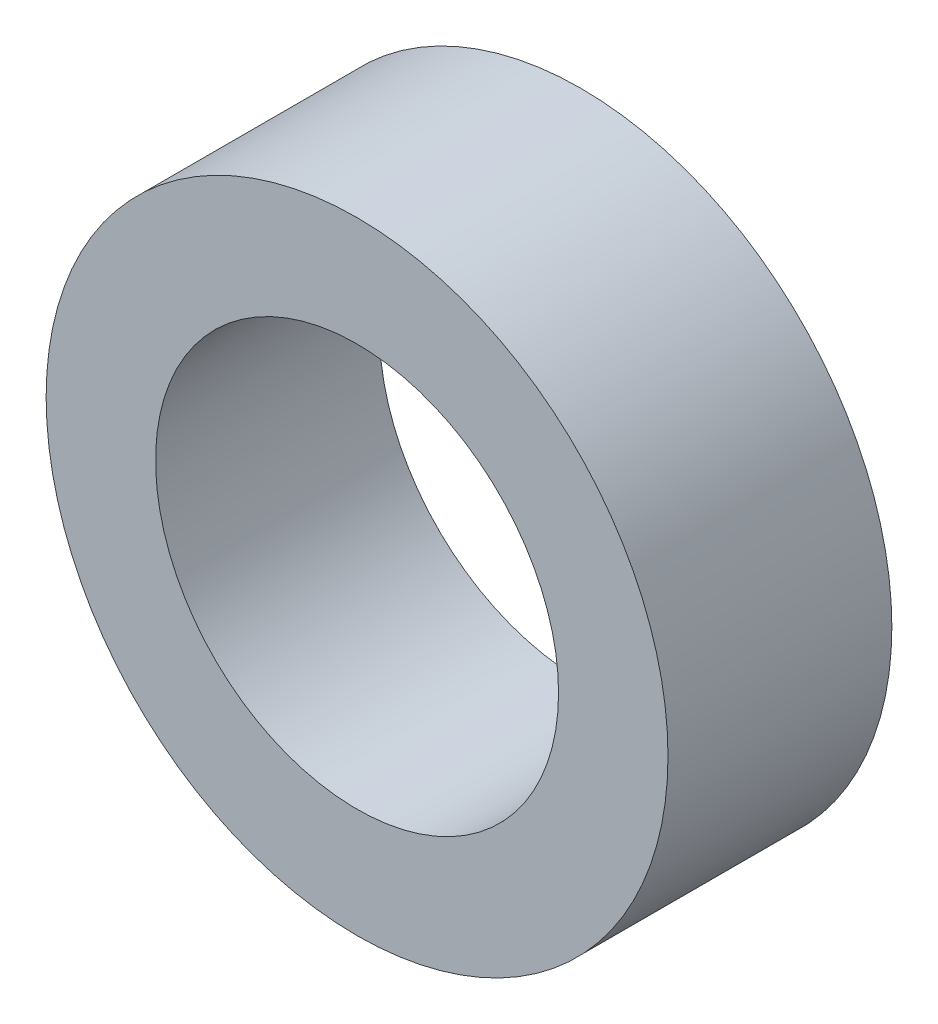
from build123d import *

# Parameters (mm, degrees)
ESQUISSE1_R      = 12.5
ESQUISSE1_R_2    = 8.1
EXTRUSION1_DEPTH = 9


with BuildPart() as part:
    # Esquisse1 → Extrusion1 (new body)
    with BuildSketch(Plane.XY):
        Circle(ESQUISSE1_R)
        Circle(ESQUISSE1_R_2, mode=Mode.SUBTRACT)
    extrude(amount=EXTRUSION1_DEPTH)


solid = part.part
